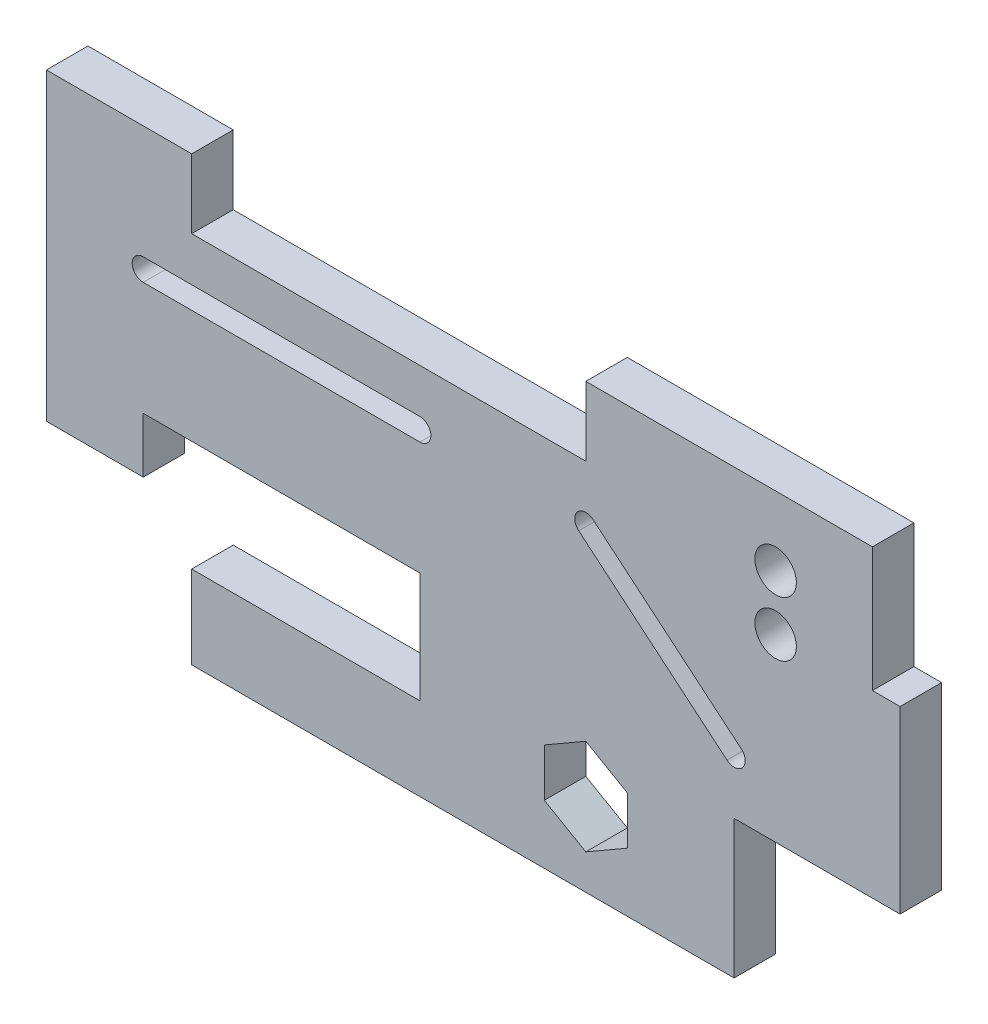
ISO-10303-21;
HEADER;
FILE_DESCRIPTION(('STEP AP214'),'2;1');
FILE_NAME('part.step','',(''),(''),'','','');
FILE_SCHEMA(('AUTOMOTIVE_DESIGN { 1 0 10303 214 1 1 1 1 }'));
ENDSEC;
DATA;
#1=APPLICATION_CONTEXT('core data for automotive mechanical design processes');
#2=APPLICATION_PROTOCOL_DEFINITION('international standard','automotive_design',2000,#1);
#3=PRODUCT_CONTEXT('',#1,'mechanical');
#4=PRODUCT('Part','Part','',(#3));
#5=PRODUCT_RELATED_PRODUCT_CATEGORY('part','',(#4));
#6=PRODUCT_DEFINITION_FORMATION('','',#4);
#7=PRODUCT_DEFINITION_CONTEXT('part definition',#1,'design');
#8=PRODUCT_DEFINITION('design','',#6,#7);
#9=PRODUCT_DEFINITION_SHAPE('','',#8);
#10=(LENGTH_UNIT() NAMED_UNIT(*) SI_UNIT(.MILLI.,.METRE.));
#11=(NAMED_UNIT(*) PLANE_ANGLE_UNIT() SI_UNIT($,.RADIAN.));
#12=(NAMED_UNIT(*) SI_UNIT($,.STERADIAN.) SOLID_ANGLE_UNIT());
#13=UNCERTAINTY_MEASURE_WITH_UNIT(LENGTH_MEASURE(1.E-05),#10,'distance_accuracy_value','');
#14=(GEOMETRIC_REPRESENTATION_CONTEXT(3) GLOBAL_UNCERTAINTY_ASSIGNED_CONTEXT((#13)) GLOBAL_UNIT_ASSIGNED_CONTEXT((#10,
#11,#12)) REPRESENTATION_CONTEXT('',''));
#15=CARTESIAN_POINT('',(0.,0.,0.));
#16=DIRECTION('',(0.,0.,1.));
#17=DIRECTION('',(1.,0.,0.));
#18=AXIS2_PLACEMENT_3D('',#15,#16,#17);
#19=CARTESIAN_POINT('',(0.,0.,9.525));
#20=DIRECTION('',(0.,0.,1.));
#21=DIRECTION('',(1.,0.,0.));
#22=AXIS2_PLACEMENT_3D('',#19,#20,#21);
#23=PLANE('',#22);
#24=CARTESIAN_POINT('',(81.6730818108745,53.975,9.525));
#25=DIRECTION('',(0.,0.,1.));
#26=DIRECTION('',(1.,0.,0.));
#27=AXIS2_PLACEMENT_3D('',#24,#25,#26);
#28=CIRCLE('',#27,4.7625);
#29=CARTESIAN_POINT('',(76.9105818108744,53.975,9.525));
#30=VERTEX_POINT('',#29);
#31=EDGE_CURVE('E364',#30,#30,#28,.T.);
#32=ORIENTED_EDGE('',*,*,#31,.F.);
#33=EDGE_LOOP('',(#32));
#34=FACE_BOUND('',#33,.T.);
#35=DIRECTION('',(-1.,0.,0.));
#36=VECTOR('',#35,1.);
#37=CARTESIAN_POINT('',(-52.3748,0.,9.525));
#38=LINE('',#37,#36);
#39=CARTESIAN_POINT('',(0.,0.,9.525));
#40=VERTEX_POINT('',#39);
#41=CARTESIAN_POINT('',(-52.3748,0.,9.525));
#42=VERTEX_POINT('',#41);
#43=EDGE_CURVE('E370',#40,#42,#38,.T.);
#44=ORIENTED_EDGE('',*,*,#43,.T.);
#45=DIRECTION('',(0.,-1.,0.));
#46=VECTOR('',#45,1.);
#47=CARTESIAN_POINT('',(-52.3748,-19.05,9.525));
#48=LINE('',#47,#46);
#49=CARTESIAN_POINT('',(-52.3748,-19.05,9.525));
#50=VERTEX_POINT('',#49);
#51=EDGE_CURVE('E373',#42,#50,#48,.T.);
#52=ORIENTED_EDGE('',*,*,#51,.T.);
#53=DIRECTION('',(1.,0.,0.));
#54=VECTOR('',#53,1.);
#55=CARTESIAN_POINT('',(72.1480818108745,-19.05,9.525));
#56=LINE('',#55,#54);
#57=CARTESIAN_POINT('',(72.1480818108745,-19.05,9.525));
#58=VERTEX_POINT('',#57);
#59=EDGE_CURVE('E376',#50,#58,#56,.T.);
#60=ORIENTED_EDGE('',*,*,#59,.T.);
#61=DIRECTION('',(0.,1.,0.));
#62=VECTOR('',#61,1.);
#63=CARTESIAN_POINT('',(72.1480818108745,12.7,9.525));
#64=LINE('',#63,#62);
#65=CARTESIAN_POINT('',(72.1480818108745,12.7,9.525));
#66=VERTEX_POINT('',#65);
#67=EDGE_CURVE('E378',#58,#66,#64,.T.);
#68=ORIENTED_EDGE('',*,*,#67,.T.);
#69=DIRECTION('',(1.,0.,0.));
#70=VECTOR('',#69,1.);
#71=CARTESIAN_POINT('',(110.248081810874,12.7,9.525));
#72=LINE('',#71,#70);
#73=CARTESIAN_POINT('',(110.248081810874,12.7,9.525));
#74=VERTEX_POINT('',#73);
#75=EDGE_CURVE('E380',#66,#74,#72,.T.);
#76=ORIENTED_EDGE('',*,*,#75,.T.);
#77=DIRECTION('',(0.,1.,0.));
#78=VECTOR('',#77,1.);
#79=CARTESIAN_POINT('',(110.248081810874,53.975,9.525));
#80=LINE('',#79,#78);
#81=CARTESIAN_POINT('',(110.248081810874,53.975,9.525));
#82=VERTEX_POINT('',#81);
#83=EDGE_CURVE('E382',#74,#82,#80,.T.);
#84=ORIENTED_EDGE('',*,*,#83,.T.);
#85=DIRECTION('',(-1.,0.,0.));
#86=VECTOR('',#85,1.);
#87=CARTESIAN_POINT('',(103.898081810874,53.975,9.525));
#88=LINE('',#87,#86);
#89=CARTESIAN_POINT('',(103.898081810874,53.975,9.525));
#90=VERTEX_POINT('',#89);
#91=EDGE_CURVE('E384',#82,#90,#88,.T.);
#92=ORIENTED_EDGE('',*,*,#91,.T.);
#93=DIRECTION('',(0.,1.,0.));
#94=VECTOR('',#93,1.);
#95=CARTESIAN_POINT('',(103.898081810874,82.55,9.525));
#96=LINE('',#95,#94);
#97=CARTESIAN_POINT('',(103.898081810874,82.55,9.525));
#98=VERTEX_POINT('',#97);
#99=EDGE_CURVE('E386',#90,#98,#96,.T.);
#100=ORIENTED_EDGE('',*,*,#99,.T.);
#101=DIRECTION('',(-1.,0.,0.));
#102=VECTOR('',#101,1.);
#103=CARTESIAN_POINT('',(38.1,82.55,9.525));
#104=LINE('',#103,#102);
#105=CARTESIAN_POINT('',(38.1,82.55,9.525));
#106=VERTEX_POINT('',#105);
#107=EDGE_CURVE('E388',#98,#106,#104,.T.);
#108=ORIENTED_EDGE('',*,*,#107,.T.);
#109=DIRECTION('',(0.,-1.,0.));
#110=VECTOR('',#109,1.);
#111=CARTESIAN_POINT('',(38.1,66.675,9.525));
#112=LINE('',#111,#110);
#113=CARTESIAN_POINT('',(38.1,66.675,9.525));
#114=VERTEX_POINT('',#113);
#115=EDGE_CURVE('E390',#106,#114,#112,.T.);
#116=ORIENTED_EDGE('',*,*,#115,.T.);
#117=DIRECTION('',(-1.,0.,0.));
#118=VECTOR('',#117,1.);
#119=CARTESIAN_POINT('',(-52.3748,66.675,9.525));
#120=LINE('',#119,#118);
#121=CARTESIAN_POINT('',(-52.3748,66.675,9.525));
#122=VERTEX_POINT('',#121);
#123=EDGE_CURVE('E392',#114,#122,#120,.T.);
#124=ORIENTED_EDGE('',*,*,#123,.T.);
#125=DIRECTION('',(0.,1.,0.));
#126=VECTOR('',#125,1.);
#127=CARTESIAN_POINT('',(-52.3748,82.55,9.525));
#128=LINE('',#127,#126);
#129=CARTESIAN_POINT('',(-52.3748,82.55,9.525));
#130=VERTEX_POINT('',#129);
#131=EDGE_CURVE('E394',#122,#130,#128,.T.);
#132=ORIENTED_EDGE('',*,*,#131,.T.);
#133=DIRECTION('',(-1.,0.,0.));
#134=VECTOR('',#133,1.);
#135=CARTESIAN_POINT('',(-85.725,82.55,9.525));
#136=LINE('',#135,#134);
#137=CARTESIAN_POINT('',(-85.725,82.55,9.525));
#138=VERTEX_POINT('',#137);
#139=EDGE_CURVE('E396',#130,#138,#136,.T.);
#140=ORIENTED_EDGE('',*,*,#139,.T.);
#141=DIRECTION('',(0.,-1.,0.));
#142=VECTOR('',#141,1.);
#143=CARTESIAN_POINT('',(-85.725,12.7,9.525));
#144=LINE('',#143,#142);
#145=CARTESIAN_POINT('',(-85.725,12.7,9.525));
#146=VERTEX_POINT('',#145);
#147=EDGE_CURVE('E398',#138,#146,#144,.T.);
#148=ORIENTED_EDGE('',*,*,#147,.T.);
#149=DIRECTION('',(1.,0.,0.));
#150=VECTOR('',#149,1.);
#151=CARTESIAN_POINT('',(-63.5,12.7,9.525));
#152=LINE('',#151,#150);
#153=CARTESIAN_POINT('',(-63.5,12.7,9.525));
#154=VERTEX_POINT('',#153);
#155=EDGE_CURVE('E400',#146,#154,#152,.T.);
#156=ORIENTED_EDGE('',*,*,#155,.T.);
#157=DIRECTION('',(0.,1.,0.));
#158=VECTOR('',#157,1.);
#159=CARTESIAN_POINT('',(-63.5,25.4,9.525));
#160=LINE('',#159,#158);
#161=CARTESIAN_POINT('',(-63.5,25.4,9.525));
#162=VERTEX_POINT('',#161);
#163=EDGE_CURVE('E402',#154,#162,#160,.T.);
#164=ORIENTED_EDGE('',*,*,#163,.T.);
#165=DIRECTION('',(1.,0.,0.));
#166=VECTOR('',#165,1.);
#167=CARTESIAN_POINT('',(0.,25.4,9.525));
#168=LINE('',#167,#166);
#169=CARTESIAN_POINT('',(0.,25.4,9.525));
#170=VERTEX_POINT('',#169);
#171=EDGE_CURVE('E404',#162,#170,#168,.T.);
#172=ORIENTED_EDGE('',*,*,#171,.T.);
#173=DIRECTION('',(0.,-1.,0.));
#174=VECTOR('',#173,1.);
#175=CARTESIAN_POINT('',(0.,0.,9.525));
#176=LINE('',#175,#174);
#177=EDGE_CURVE('E406',#170,#40,#176,.T.);
#178=ORIENTED_EDGE('',*,*,#177,.T.);
#179=EDGE_LOOP('',(#44,#52,#60,#68,#76,#84,#92,#100,#108,#116,#124,#132,#140,#148,#156,#164,
#172,#178));
#180=FACE_BOUND('',#179,.T.);
#181=CARTESIAN_POINT('',(81.6730818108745,66.675,9.525));
#182=DIRECTION('',(0.,0.,1.));
#183=DIRECTION('',(1.,0.,0.));
#184=AXIS2_PLACEMENT_3D('',#181,#182,#183);
#185=CIRCLE('',#184,4.7625);
#186=CARTESIAN_POINT('',(76.9105818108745,66.675,9.525));
#187=VERTEX_POINT('',#186);
#188=EDGE_CURVE('E358',#187,#187,#185,.T.);
#189=ORIENTED_EDGE('',*,*,#188,.F.);
#190=EDGE_LOOP('',(#189));
#191=FACE_BOUND('',#190,.T.);
#192=DIRECTION('',(1.,0.,0.));
#193=VECTOR('',#192,1.);
#194=CARTESIAN_POINT('',(-63.5,51.435,9.525));
#195=LINE('',#194,#193);
#196=CARTESIAN_POINT('',(-63.5,51.435,9.525));
#197=VERTEX_POINT('',#196);
#198=CARTESIAN_POINT('',(0.,51.435,9.525));
#199=VERTEX_POINT('',#198);
#200=EDGE_CURVE('E329',#197,#199,#195,.T.);
#201=ORIENTED_EDGE('',*,*,#200,.F.);
#202=CARTESIAN_POINT('',(-63.5,53.975,9.525));
#203=DIRECTION('',(0.,0.,1.));
#204=DIRECTION('',(1.,0.,0.));
#205=AXIS2_PLACEMENT_3D('',#202,#203,#204);
#206=CIRCLE('',#205,2.54);
#207=CARTESIAN_POINT('',(-63.5,56.515,9.525));
#208=VERTEX_POINT('',#207);
#209=EDGE_CURVE('E327',#208,#197,#206,.T.);
#210=ORIENTED_EDGE('',*,*,#209,.F.);
#211=DIRECTION('',(-1.,0.,0.));
#212=VECTOR('',#211,1.);
#213=CARTESIAN_POINT('',(-63.5,56.515,9.525));
#214=LINE('',#213,#212);
#215=CARTESIAN_POINT('',(0.,56.515,9.525));
#216=VERTEX_POINT('',#215);
#217=EDGE_CURVE('E335',#216,#208,#214,.T.);
#218=ORIENTED_EDGE('',*,*,#217,.F.);
#219=CARTESIAN_POINT('',(0.,53.975,9.525));
#220=DIRECTION('',(0.,0.,1.));
#221=DIRECTION('',(1.,0.,0.));
#222=AXIS2_PLACEMENT_3D('',#219,#220,#221);
#223=CIRCLE('',#222,2.54);
#224=EDGE_CURVE('E332',#199,#216,#223,.T.);
#225=ORIENTED_EDGE('',*,*,#224,.F.);
#226=EDGE_LOOP('',(#201,#210,#218,#225));
#227=FACE_BOUND('',#226,.T.);
#228=DIRECTION('',(-0.866025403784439,-0.5,0.));
#229=VECTOR('',#228,1.);
#230=CARTESIAN_POINT('',(38.1,10.9985226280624,9.525));
#231=LINE('',#230,#229);
#232=CARTESIAN_POINT('',(38.1,10.9985226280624,9.525));
#233=VERTEX_POINT('',#232);
#234=CARTESIAN_POINT('',(28.575,5.49926131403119,9.525));
#235=VERTEX_POINT('',#234);
#236=EDGE_CURVE('E284',#233,#235,#231,.T.);
#237=ORIENTED_EDGE('',*,*,#236,.F.);
#238=DIRECTION('',(-0.866025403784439,0.5,0.));
#239=VECTOR('',#238,1.);
#240=CARTESIAN_POINT('',(47.625,5.49926131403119,9.525));
#241=LINE('',#240,#239);
#242=CARTESIAN_POINT('',(47.625,5.49926131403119,9.525));
#243=VERTEX_POINT('',#242);
#244=EDGE_CURVE('E282',#243,#233,#241,.T.);
#245=ORIENTED_EDGE('',*,*,#244,.F.);
#246=DIRECTION('',(0.,1.,0.));
#247=VECTOR('',#246,1.);
#248=CARTESIAN_POINT('',(47.625,-5.49926131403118,9.525));
#249=LINE('',#248,#247);
#250=CARTESIAN_POINT('',(47.625,-5.49926131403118,9.525));
#251=VERTEX_POINT('',#250);
#252=EDGE_CURVE('E294',#251,#243,#249,.T.);
#253=ORIENTED_EDGE('',*,*,#252,.F.);
#254=DIRECTION('',(0.866025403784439,0.5,0.));
#255=VECTOR('',#254,1.);
#256=CARTESIAN_POINT('',(38.1,-10.9985226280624,9.525));
#257=LINE('',#256,#255);
#258=CARTESIAN_POINT('',(38.1,-10.9985226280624,9.525));
#259=VERTEX_POINT('',#258);
#260=EDGE_CURVE('E291',#259,#251,#257,.T.);
#261=ORIENTED_EDGE('',*,*,#260,.F.);
#262=DIRECTION('',(0.866025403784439,-0.5,0.));
#263=VECTOR('',#262,1.);
#264=CARTESIAN_POINT('',(28.575,-5.49926131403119,9.525));
#265=LINE('',#264,#263);
#266=CARTESIAN_POINT('',(28.575,-5.49926131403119,9.525));
#267=VERTEX_POINT('',#266);
#268=EDGE_CURVE('E289',#267,#259,#265,.T.);
#269=ORIENTED_EDGE('',*,*,#268,.F.);
#270=DIRECTION('',(0.,-1.,0.));
#271=VECTOR('',#270,1.);
#272=CARTESIAN_POINT('',(28.575,5.49926131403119,9.525));
#273=LINE('',#272,#271);
#274=EDGE_CURVE('E287',#235,#267,#273,.T.);
#275=ORIENTED_EDGE('',*,*,#274,.F.);
#276=EDGE_LOOP('',(#237,#245,#253,#261,#269,#275));
#277=FACE_BOUND('',#276,.T.);
#278=DIRECTION('',(0.765986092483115,-0.642857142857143,0.));
#279=VECTOR('',#278,1.);
#280=CARTESIAN_POINT('',(36.4671428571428,52.0293953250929,9.525));
#281=LINE('',#280,#279);
#282=CARTESIAN_POINT('',(36.4671428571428,52.0293953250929,9.525));
#283=VERTEX_POINT('',#282);
#284=CARTESIAN_POINT('',(70.5152246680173,23.4543953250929,9.525));
#285=VERTEX_POINT('',#284);
#286=EDGE_CURVE('E254',#283,#285,#281,.T.);
#287=ORIENTED_EDGE('',*,*,#286,.F.);
#288=CARTESIAN_POINT('',(38.1,53.975,9.525));
#289=DIRECTION('',(0.,0.,1.));
#290=DIRECTION('',(1.,0.,0.));
#291=AXIS2_PLACEMENT_3D('',#288,#289,#290);
#292=CIRCLE('',#291,2.54000000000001);
#293=CARTESIAN_POINT('',(39.7328571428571,55.9206046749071,9.525));
#294=VERTEX_POINT('',#293);
#295=EDGE_CURVE('E246',#294,#283,#292,.T.);
#296=ORIENTED_EDGE('',*,*,#295,.F.);
#297=DIRECTION('',(-0.765986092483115,0.642857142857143,0.));
#298=VECTOR('',#297,1.);
#299=CARTESIAN_POINT('',(39.7328571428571,55.9206046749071,9.525));
#300=LINE('',#299,#298);
#301=CARTESIAN_POINT('',(73.7809389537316,27.3456046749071,9.525));
#302=VERTEX_POINT('',#301);
#303=EDGE_CURVE('E268',#302,#294,#300,.T.);
#304=ORIENTED_EDGE('',*,*,#303,.F.);
#305=CARTESIAN_POINT('',(72.1480818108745,25.4,9.525));
#306=DIRECTION('',(0.,0.,1.));
#307=DIRECTION('',(1.,0.,0.));
#308=AXIS2_PLACEMENT_3D('',#305,#306,#307);
#309=CIRCLE('',#308,2.54000000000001);
#310=EDGE_CURVE('E266',#285,#302,#309,.T.);
#311=ORIENTED_EDGE('',*,*,#310,.F.);
#312=EDGE_LOOP('',(#287,#296,#304,#311));
#313=FACE_BOUND('',#312,.T.);
#314=ADVANCED_FACE('F37',(#34,#180,#191,#227,#277,#313),#23,.T.);
#315=CARTESIAN_POINT('',(0.,0.,0.));
#316=DIRECTION('',(0.,0.,1.));
#317=DIRECTION('',(1.,0.,0.));
#318=AXIS2_PLACEMENT_3D('',#315,#316,#317);
#319=PLANE('',#318);
#320=DIRECTION('',(-0.866025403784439,0.5,0.));
#321=VECTOR('',#320,1.);
#322=CARTESIAN_POINT('',(47.625,5.49926131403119,0.));
#323=LINE('',#322,#321);
#324=CARTESIAN_POINT('',(47.625,5.49926131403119,0.));
#325=VERTEX_POINT('',#324);
#326=CARTESIAN_POINT('',(38.1,10.9985226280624,0.));
#327=VERTEX_POINT('',#326);
#328=EDGE_CURVE('E262',#325,#327,#323,.T.);
#329=ORIENTED_EDGE('',*,*,#328,.T.);
#330=DIRECTION('',(-0.866025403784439,-0.5,0.));
#331=VECTOR('',#330,1.);
#332=CARTESIAN_POINT('',(38.1,10.9985226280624,0.));
#333=LINE('',#332,#331);
#334=CARTESIAN_POINT('',(28.575,5.49926131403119,0.));
#335=VERTEX_POINT('',#334);
#336=EDGE_CURVE('E299',#327,#335,#333,.T.);
#337=ORIENTED_EDGE('',*,*,#336,.T.);
#338=DIRECTION('',(0.,-1.,0.));
#339=VECTOR('',#338,1.);
#340=CARTESIAN_POINT('',(28.575,5.49926131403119,0.));
#341=LINE('',#340,#339);
#342=CARTESIAN_POINT('',(28.575,-5.49926131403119,0.));
#343=VERTEX_POINT('',#342);
#344=EDGE_CURVE('E302',#335,#343,#341,.T.);
#345=ORIENTED_EDGE('',*,*,#344,.T.);
#346=DIRECTION('',(0.866025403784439,-0.5,0.));
#347=VECTOR('',#346,1.);
#348=CARTESIAN_POINT('',(28.575,-5.49926131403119,0.));
#349=LINE('',#348,#347);
#350=CARTESIAN_POINT('',(38.1,-10.9985226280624,0.));
#351=VERTEX_POINT('',#350);
#352=EDGE_CURVE('E305',#343,#351,#349,.T.);
#353=ORIENTED_EDGE('',*,*,#352,.T.);
#354=DIRECTION('',(0.866025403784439,0.5,0.));
#355=VECTOR('',#354,1.);
#356=CARTESIAN_POINT('',(38.1,-10.9985226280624,0.));
#357=LINE('',#356,#355);
#358=CARTESIAN_POINT('',(47.625,-5.49926131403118,0.));
#359=VERTEX_POINT('',#358);
#360=EDGE_CURVE('E308',#351,#359,#357,.T.);
#361=ORIENTED_EDGE('',*,*,#360,.T.);
#362=DIRECTION('',(0.,1.,0.));
#363=VECTOR('',#362,1.);
#364=CARTESIAN_POINT('',(47.625,-5.49926131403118,0.));
#365=LINE('',#364,#363);
#366=EDGE_CURVE('E285',#359,#325,#365,.T.);
#367=ORIENTED_EDGE('',*,*,#366,.T.);
#368=EDGE_LOOP('',(#329,#337,#345,#353,#361,#367));
#369=FACE_BOUND('',#368,.T.);
#370=CARTESIAN_POINT('',(81.6730818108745,66.675,0.));
#371=DIRECTION('',(0.,0.,1.));
#372=DIRECTION('',(1.,0.,0.));
#373=AXIS2_PLACEMENT_3D('',#370,#371,#372);
#374=CIRCLE('',#373,4.7625);
#375=CARTESIAN_POINT('',(76.9105818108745,66.675,0.));
#376=VERTEX_POINT('',#375);
#377=EDGE_CURVE('E357',#376,#376,#374,.T.);
#378=ORIENTED_EDGE('',*,*,#377,.T.);
#379=EDGE_LOOP('',(#378));
#380=FACE_BOUND('',#379,.T.);
#381=CARTESIAN_POINT('',(81.6730818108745,53.975,0.));
#382=DIRECTION('',(0.,0.,1.));
#383=DIRECTION('',(1.,0.,0.));
#384=AXIS2_PLACEMENT_3D('',#381,#382,#383);
#385=CIRCLE('',#384,4.7625);
#386=CARTESIAN_POINT('',(76.9105818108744,53.975,0.));
#387=VERTEX_POINT('',#386);
#388=EDGE_CURVE('E361',#387,#387,#385,.T.);
#389=ORIENTED_EDGE('',*,*,#388,.T.);
#390=EDGE_LOOP('',(#389));
#391=FACE_BOUND('',#390,.T.);
#392=DIRECTION('',(-1.,0.,0.));
#393=VECTOR('',#392,1.);
#394=CARTESIAN_POINT('',(-52.3748,0.,0.));
#395=LINE('',#394,#393);
#396=CARTESIAN_POINT('',(0.,0.,0.));
#397=VERTEX_POINT('',#396);
#398=CARTESIAN_POINT('',(-52.3748,0.,0.));
#399=VERTEX_POINT('',#398);
#400=EDGE_CURVE('E367',#397,#399,#395,.T.);
#401=ORIENTED_EDGE('',*,*,#400,.F.);
#402=DIRECTION('',(0.,-1.,0.));
#403=VECTOR('',#402,1.);
#404=CARTESIAN_POINT('',(0.,0.,0.));
#405=LINE('',#404,#403);
#406=CARTESIAN_POINT('',(0.,25.4,0.));
#407=VERTEX_POINT('',#406);
#408=EDGE_CURVE('E374',#407,#397,#405,.T.);
#409=ORIENTED_EDGE('',*,*,#408,.F.);
#410=DIRECTION('',(1.,0.,0.));
#411=VECTOR('',#410,1.);
#412=CARTESIAN_POINT('',(0.,25.4,0.));
#413=LINE('',#412,#411);
#414=CARTESIAN_POINT('',(-63.5,25.4,0.));
#415=VERTEX_POINT('',#414);
#416=EDGE_CURVE('E441',#415,#407,#413,.T.);
#417=ORIENTED_EDGE('',*,*,#416,.F.);
#418=DIRECTION('',(0.,1.,0.));
#419=VECTOR('',#418,1.);
#420=CARTESIAN_POINT('',(-63.5,25.4,0.));
#421=LINE('',#420,#419);
#422=CARTESIAN_POINT('',(-63.5,12.7,0.));
#423=VERTEX_POINT('',#422);
#424=EDGE_CURVE('E439',#423,#415,#421,.T.);
#425=ORIENTED_EDGE('',*,*,#424,.F.);
#426=DIRECTION('',(1.,0.,0.));
#427=VECTOR('',#426,1.);
#428=CARTESIAN_POINT('',(-63.5,12.7,0.));
#429=LINE('',#428,#427);
#430=CARTESIAN_POINT('',(-85.725,12.7,0.));
#431=VERTEX_POINT('',#430);
#432=EDGE_CURVE('E437',#431,#423,#429,.T.);
#433=ORIENTED_EDGE('',*,*,#432,.F.);
#434=DIRECTION('',(0.,-1.,0.));
#435=VECTOR('',#434,1.);
#436=CARTESIAN_POINT('',(-85.725,12.7,0.));
#437=LINE('',#436,#435);
#438=CARTESIAN_POINT('',(-85.725,82.55,0.));
#439=VERTEX_POINT('',#438);
#440=EDGE_CURVE('E435',#439,#431,#437,.T.);
#441=ORIENTED_EDGE('',*,*,#440,.F.);
#442=DIRECTION('',(-1.,0.,0.));
#443=VECTOR('',#442,1.);
#444=CARTESIAN_POINT('',(-85.725,82.55,0.));
#445=LINE('',#444,#443);
#446=CARTESIAN_POINT('',(-52.3748,82.55,0.));
#447=VERTEX_POINT('',#446);
#448=EDGE_CURVE('E433',#447,#439,#445,.T.);
#449=ORIENTED_EDGE('',*,*,#448,.F.);
#450=DIRECTION('',(0.,1.,0.));
#451=VECTOR('',#450,1.);
#452=CARTESIAN_POINT('',(-52.3748,82.55,0.));
#453=LINE('',#452,#451);
#454=CARTESIAN_POINT('',(-52.3748,66.675,0.));
#455=VERTEX_POINT('',#454);
#456=EDGE_CURVE('E431',#455,#447,#453,.T.);
#457=ORIENTED_EDGE('',*,*,#456,.F.);
#458=DIRECTION('',(-1.,0.,0.));
#459=VECTOR('',#458,1.);
#460=CARTESIAN_POINT('',(-52.3748,66.675,0.));
#461=LINE('',#460,#459);
#462=CARTESIAN_POINT('',(38.1,66.675,0.));
#463=VERTEX_POINT('',#462);
#464=EDGE_CURVE('E429',#463,#455,#461,.T.);
#465=ORIENTED_EDGE('',*,*,#464,.F.);
#466=DIRECTION('',(0.,-1.,0.));
#467=VECTOR('',#466,1.);
#468=CARTESIAN_POINT('',(38.1,66.675,0.));
#469=LINE('',#468,#467);
#470=CARTESIAN_POINT('',(38.1,82.55,0.));
#471=VERTEX_POINT('',#470);
#472=EDGE_CURVE('E427',#471,#463,#469,.T.);
#473=ORIENTED_EDGE('',*,*,#472,.F.);
#474=DIRECTION('',(-1.,0.,0.));
#475=VECTOR('',#474,1.);
#476=CARTESIAN_POINT('',(38.1,82.55,0.));
#477=LINE('',#476,#475);
#478=CARTESIAN_POINT('',(103.898081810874,82.55,0.));
#479=VERTEX_POINT('',#478);
#480=EDGE_CURVE('E425',#479,#471,#477,.T.);
#481=ORIENTED_EDGE('',*,*,#480,.F.);
#482=DIRECTION('',(0.,1.,0.));
#483=VECTOR('',#482,1.);
#484=CARTESIAN_POINT('',(103.898081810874,82.55,0.));
#485=LINE('',#484,#483);
#486=CARTESIAN_POINT('',(103.898081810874,53.975,0.));
#487=VERTEX_POINT('',#486);
#488=EDGE_CURVE('E423',#487,#479,#485,.T.);
#489=ORIENTED_EDGE('',*,*,#488,.F.);
#490=DIRECTION('',(-1.,0.,0.));
#491=VECTOR('',#490,1.);
#492=CARTESIAN_POINT('',(103.898081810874,53.975,0.));
#493=LINE('',#492,#491);
#494=CARTESIAN_POINT('',(110.248081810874,53.975,0.));
#495=VERTEX_POINT('',#494);
#496=EDGE_CURVE('E421',#495,#487,#493,.T.);
#497=ORIENTED_EDGE('',*,*,#496,.F.);
#498=DIRECTION('',(0.,1.,0.));
#499=VECTOR('',#498,1.);
#500=CARTESIAN_POINT('',(110.248081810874,53.975,0.));
#501=LINE('',#500,#499);
#502=CARTESIAN_POINT('',(110.248081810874,12.7,0.));
#503=VERTEX_POINT('',#502);
#504=EDGE_CURVE('E419',#503,#495,#501,.T.);
#505=ORIENTED_EDGE('',*,*,#504,.F.);
#506=DIRECTION('',(1.,0.,0.));
#507=VECTOR('',#506,1.);
#508=CARTESIAN_POINT('',(110.248081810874,12.7,0.));
#509=LINE('',#508,#507);
#510=CARTESIAN_POINT('',(72.1480818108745,12.7,0.));
#511=VERTEX_POINT('',#510);
#512=EDGE_CURVE('E417',#511,#503,#509,.T.);
#513=ORIENTED_EDGE('',*,*,#512,.F.);
#514=DIRECTION('',(0.,1.,0.));
#515=VECTOR('',#514,1.);
#516=CARTESIAN_POINT('',(72.1480818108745,12.7,0.));
#517=LINE('',#516,#515);
#518=CARTESIAN_POINT('',(72.1480818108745,-19.05,0.));
#519=VERTEX_POINT('',#518);
#520=EDGE_CURVE('E415',#519,#511,#517,.T.);
#521=ORIENTED_EDGE('',*,*,#520,.F.);
#522=DIRECTION('',(1.,0.,0.));
#523=VECTOR('',#522,1.);
#524=CARTESIAN_POINT('',(72.1480818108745,-19.05,0.));
#525=LINE('',#524,#523);
#526=CARTESIAN_POINT('',(-52.3748,-19.05,0.));
#527=VERTEX_POINT('',#526);
#528=EDGE_CURVE('E413',#527,#519,#525,.T.);
#529=ORIENTED_EDGE('',*,*,#528,.F.);
#530=DIRECTION('',(0.,-1.,0.));
#531=VECTOR('',#530,1.);
#532=CARTESIAN_POINT('',(-52.3748,-19.05,0.));
#533=LINE('',#532,#531);
#534=EDGE_CURVE('E411',#399,#527,#533,.T.);
#535=ORIENTED_EDGE('',*,*,#534,.F.);
#536=EDGE_LOOP('',(#401,#409,#417,#425,#433,#441,#449,#457,#465,#473,#481,#489,#497,#505,#513,
#521,#529,#535));
#537=FACE_BOUND('',#536,.T.);
#538=CARTESIAN_POINT('',(-63.5,53.975,0.));
#539=DIRECTION('',(0.,0.,1.));
#540=DIRECTION('',(1.,0.,0.));
#541=AXIS2_PLACEMENT_3D('',#538,#539,#540);
#542=CIRCLE('',#541,2.54);
#543=CARTESIAN_POINT('',(-63.5,56.515,0.));
#544=VERTEX_POINT('',#543);
#545=CARTESIAN_POINT('',(-63.5,51.435,0.));
#546=VERTEX_POINT('',#545);
#547=EDGE_CURVE('E326',#544,#546,#542,.T.);
#548=ORIENTED_EDGE('',*,*,#547,.T.);
#549=DIRECTION('',(1.,0.,0.));
#550=VECTOR('',#549,1.);
#551=CARTESIAN_POINT('',(-63.5,51.435,0.));
#552=LINE('',#551,#550);
#553=CARTESIAN_POINT('',(0.,51.435,0.));
#554=VERTEX_POINT('',#553);
#555=EDGE_CURVE('E340',#546,#554,#552,.T.);
#556=ORIENTED_EDGE('',*,*,#555,.T.);
#557=CARTESIAN_POINT('',(0.,53.975,0.));
#558=DIRECTION('',(0.,0.,1.));
#559=DIRECTION('',(1.,0.,0.));
#560=AXIS2_PLACEMENT_3D('',#557,#558,#559);
#561=CIRCLE('',#560,2.54);
#562=CARTESIAN_POINT('',(0.,56.515,0.));
#563=VERTEX_POINT('',#562);
#564=EDGE_CURVE('E343',#554,#563,#561,.T.);
#565=ORIENTED_EDGE('',*,*,#564,.T.);
#566=DIRECTION('',(-1.,0.,0.));
#567=VECTOR('',#566,1.);
#568=CARTESIAN_POINT('',(-63.5,56.515,0.));
#569=LINE('',#568,#567);
#570=EDGE_CURVE('E330',#563,#544,#569,.T.);
#571=ORIENTED_EDGE('',*,*,#570,.T.);
#572=EDGE_LOOP('',(#548,#556,#565,#571));
#573=FACE_BOUND('',#572,.T.);
#574=CARTESIAN_POINT('',(38.1,53.975,0.));
#575=DIRECTION('',(0.,0.,1.));
#576=DIRECTION('',(1.,0.,0.));
#577=AXIS2_PLACEMENT_3D('',#574,#575,#576);
#578=CIRCLE('',#577,2.54000000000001);
#579=CARTESIAN_POINT('',(39.7328571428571,55.9206046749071,0.));
#580=VERTEX_POINT('',#579);
#581=CARTESIAN_POINT('',(36.4671428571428,52.0293953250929,0.));
#582=VERTEX_POINT('',#581);
#583=EDGE_CURVE('E60',#580,#582,#578,.T.);
#584=ORIENTED_EDGE('',*,*,#583,.T.);
#585=DIRECTION('',(0.765986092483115,-0.642857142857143,0.));
#586=VECTOR('',#585,1.);
#587=CARTESIAN_POINT('',(36.4671428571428,52.0293953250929,0.));
#588=LINE('',#587,#586);
#589=CARTESIAN_POINT('',(70.5152246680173,23.4543953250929,0.));
#590=VERTEX_POINT('',#589);
#591=EDGE_CURVE('E261',#582,#590,#588,.T.);
#592=ORIENTED_EDGE('',*,*,#591,.T.);
#593=CARTESIAN_POINT('',(72.1480818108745,25.4,0.));
#594=DIRECTION('',(0.,0.,1.));
#595=DIRECTION('',(1.,0.,0.));
#596=AXIS2_PLACEMENT_3D('',#593,#594,#595);
#597=CIRCLE('',#596,2.54000000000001);
#598=CARTESIAN_POINT('',(73.7809389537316,27.3456046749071,0.));
#599=VERTEX_POINT('',#598);
#600=EDGE_CURVE('E274',#590,#599,#597,.T.);
#601=ORIENTED_EDGE('',*,*,#600,.T.);
#602=DIRECTION('',(-0.765986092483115,0.642857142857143,0.));
#603=VECTOR('',#602,1.);
#604=CARTESIAN_POINT('',(39.7328571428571,55.9206046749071,0.));
#605=LINE('',#604,#603);
#606=EDGE_CURVE('E255',#599,#580,#605,.T.);
#607=ORIENTED_EDGE('',*,*,#606,.T.);
#608=EDGE_LOOP('',(#584,#592,#601,#607));
#609=FACE_BOUND('',#608,.T.);
#610=ADVANCED_FACE('F501',(#369,#380,#391,#537,#573,#609),#319,.F.);
#611=CARTESIAN_POINT('',(-52.3748,0.,9.525));
#612=DIRECTION('',(0.,-1.,0.));
#613=DIRECTION('',(0.,0.,-1.));
#614=AXIS2_PLACEMENT_3D('',#611,#612,#613);
#615=PLANE('',#614);
#616=ORIENTED_EDGE('',*,*,#400,.T.);
#617=DIRECTION('',(0.,0.,-1.));
#618=VECTOR('',#617,1.);
#619=CARTESIAN_POINT('',(-52.3748,0.,9.525));
#620=LINE('',#619,#618);
#621=EDGE_CURVE('E11',#42,#399,#620,.T.);
#622=ORIENTED_EDGE('',*,*,#621,.F.);
#623=ORIENTED_EDGE('',*,*,#43,.F.);
#624=DIRECTION('',(0.,0.,-1.));
#625=VECTOR('',#624,1.);
#626=CARTESIAN_POINT('',(0.,0.,9.525));
#627=LINE('',#626,#625);
#628=EDGE_CURVE('E408',#40,#397,#627,.T.);
#629=ORIENTED_EDGE('',*,*,#628,.T.);
#630=EDGE_LOOP('',(#616,#622,#623,#629));
#631=FACE_BOUND('',#630,.T.);
#632=ADVANCED_FACE('F39',(#631),#615,.F.);
#633=CARTESIAN_POINT('',(-52.3748,-19.05,9.525));
#634=DIRECTION('',(1.,0.,0.));
#635=DIRECTION('',(0.,0.,-1.));
#636=AXIS2_PLACEMENT_3D('',#633,#634,#635);
#637=PLANE('',#636);
#638=ORIENTED_EDGE('',*,*,#534,.T.);
#639=DIRECTION('',(0.,0.,-1.));
#640=VECTOR('',#639,1.);
#641=CARTESIAN_POINT('',(-52.3748,-19.05,9.525));
#642=LINE('',#641,#640);
#643=EDGE_CURVE('E45',#50,#527,#642,.T.);
#644=ORIENTED_EDGE('',*,*,#643,.F.);
#645=ORIENTED_EDGE('',*,*,#51,.F.);
#646=ORIENTED_EDGE('',*,*,#621,.T.);
#647=EDGE_LOOP('',(#638,#644,#645,#646));
#648=FACE_BOUND('',#647,.T.);
#649=ADVANCED_FACE('F519',(#648),#637,.F.);
#650=CARTESIAN_POINT('',(72.1480818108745,-19.05,9.525));
#651=DIRECTION('',(0.,1.,0.));
#652=DIRECTION('',(-1.,0.,0.));
#653=AXIS2_PLACEMENT_3D('',#650,#651,#652);
#654=PLANE('',#653);
#655=ORIENTED_EDGE('',*,*,#528,.T.);
#656=DIRECTION('',(0.,0.,-1.));
#657=VECTOR('',#656,1.);
#658=CARTESIAN_POINT('',(72.1480818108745,-19.05,9.525));
#659=LINE('',#658,#657);
#660=EDGE_CURVE('E488',#58,#519,#659,.T.);
#661=ORIENTED_EDGE('',*,*,#660,.F.);
#662=ORIENTED_EDGE('',*,*,#59,.F.);
#663=ORIENTED_EDGE('',*,*,#643,.T.);
#664=EDGE_LOOP('',(#655,#661,#662,#663));
#665=FACE_BOUND('',#664,.T.);
#666=ADVANCED_FACE('F495',(#665),#654,.F.);
#667=CARTESIAN_POINT('',(72.1480818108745,12.7,9.525));
#668=DIRECTION('',(-1.,0.,0.));
#669=DIRECTION('',(0.,-1.,0.));
#670=AXIS2_PLACEMENT_3D('',#667,#668,#669);
#671=PLANE('',#670);
#672=ORIENTED_EDGE('',*,*,#520,.T.);
#673=DIRECTION('',(0.,0.,-1.));
#674=VECTOR('',#673,1.);
#675=CARTESIAN_POINT('',(72.1480818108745,12.7,9.525));
#676=LINE('',#675,#674);
#677=EDGE_CURVE('E485',#66,#511,#676,.T.);
#678=ORIENTED_EDGE('',*,*,#677,.F.);
#679=ORIENTED_EDGE('',*,*,#67,.F.);
#680=ORIENTED_EDGE('',*,*,#660,.T.);
#681=EDGE_LOOP('',(#672,#678,#679,#680));
#682=FACE_BOUND('',#681,.T.);
#683=ADVANCED_FACE('F507',(#682),#671,.F.);
#684=CARTESIAN_POINT('',(110.248081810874,12.7,9.525));
#685=DIRECTION('',(0.,1.,0.));
#686=DIRECTION('',(-1.,0.,0.));
#687=AXIS2_PLACEMENT_3D('',#684,#685,#686);
#688=PLANE('',#687);
#689=ORIENTED_EDGE('',*,*,#512,.T.);
#690=DIRECTION('',(0.,0.,-1.));
#691=VECTOR('',#690,1.);
#692=CARTESIAN_POINT('',(110.248081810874,12.7,9.525));
#693=LINE('',#692,#691);
#694=EDGE_CURVE('E482',#74,#503,#693,.T.);
#695=ORIENTED_EDGE('',*,*,#694,.F.);
#696=ORIENTED_EDGE('',*,*,#75,.F.);
#697=ORIENTED_EDGE('',*,*,#677,.T.);
#698=EDGE_LOOP('',(#689,#695,#696,#697));
#699=FACE_BOUND('',#698,.T.);
#700=ADVANCED_FACE('F511',(#699),#688,.F.);
#701=CARTESIAN_POINT('',(110.248081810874,53.975,9.525));
#702=DIRECTION('',(-1.,0.,0.));
#703=DIRECTION('',(0.,-1.,0.));
#704=AXIS2_PLACEMENT_3D('',#701,#702,#703);
#705=PLANE('',#704);
#706=ORIENTED_EDGE('',*,*,#504,.T.);
#707=DIRECTION('',(0.,0.,-1.));
#708=VECTOR('',#707,1.);
#709=CARTESIAN_POINT('',(110.248081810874,53.975,9.525));
#710=LINE('',#709,#708);
#711=EDGE_CURVE('E479',#82,#495,#710,.T.);
#712=ORIENTED_EDGE('',*,*,#711,.F.);
#713=ORIENTED_EDGE('',*,*,#83,.F.);
#714=ORIENTED_EDGE('',*,*,#694,.T.);
#715=EDGE_LOOP('',(#706,#712,#713,#714));
#716=FACE_BOUND('',#715,.T.);
#717=ADVANCED_FACE('F582',(#716),#705,.F.);
#718=CARTESIAN_POINT('',(103.898081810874,53.975,9.525));
#719=DIRECTION('',(0.,-1.,0.));
#720=DIRECTION('',(1.,0.,0.));
#721=AXIS2_PLACEMENT_3D('',#718,#719,#720);
#722=PLANE('',#721);
#723=ORIENTED_EDGE('',*,*,#496,.T.);
#724=DIRECTION('',(0.,0.,-1.));
#725=VECTOR('',#724,1.);
#726=CARTESIAN_POINT('',(103.898081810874,53.975,9.525));
#727=LINE('',#726,#725);
#728=EDGE_CURVE('E476',#90,#487,#727,.T.);
#729=ORIENTED_EDGE('',*,*,#728,.F.);
#730=ORIENTED_EDGE('',*,*,#91,.F.);
#731=ORIENTED_EDGE('',*,*,#711,.T.);
#732=EDGE_LOOP('',(#723,#729,#730,#731));
#733=FACE_BOUND('',#732,.T.);
#734=ADVANCED_FACE('F580',(#733),#722,.F.);
#735=CARTESIAN_POINT('',(103.898081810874,82.55,9.525));
#736=DIRECTION('',(-1.,0.,0.));
#737=DIRECTION('',(0.,0.,1.));
#738=AXIS2_PLACEMENT_3D('',#735,#736,#737);
#739=PLANE('',#738);
#740=ORIENTED_EDGE('',*,*,#488,.T.);
#741=DIRECTION('',(0.,0.,-1.));
#742=VECTOR('',#741,1.);
#743=CARTESIAN_POINT('',(103.898081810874,82.55,9.525));
#744=LINE('',#743,#742);
#745=EDGE_CURVE('E473',#98,#479,#744,.T.);
#746=ORIENTED_EDGE('',*,*,#745,.F.);
#747=ORIENTED_EDGE('',*,*,#99,.F.);
#748=ORIENTED_EDGE('',*,*,#728,.T.);
#749=EDGE_LOOP('',(#740,#746,#747,#748));
#750=FACE_BOUND('',#749,.T.);
#751=ADVANCED_FACE('F576',(#750),#739,.F.);
#752=CARTESIAN_POINT('',(38.1,82.55,9.525));
#753=DIRECTION('',(0.,-1.,0.));
#754=DIRECTION('',(0.,0.,-1.));
#755=AXIS2_PLACEMENT_3D('',#752,#753,#754);
#756=PLANE('',#755);
#757=ORIENTED_EDGE('',*,*,#480,.T.);
#758=DIRECTION('',(0.,0.,-1.));
#759=VECTOR('',#758,1.);
#760=CARTESIAN_POINT('',(38.1,82.55,9.525));
#761=LINE('',#760,#759);
#762=EDGE_CURVE('E470',#106,#471,#761,.T.);
#763=ORIENTED_EDGE('',*,*,#762,.F.);
#764=ORIENTED_EDGE('',*,*,#107,.F.);
#765=ORIENTED_EDGE('',*,*,#745,.T.);
#766=EDGE_LOOP('',(#757,#763,#764,#765));
#767=FACE_BOUND('',#766,.T.);
#768=ADVANCED_FACE('F571',(#767),#756,.F.);
#769=CARTESIAN_POINT('',(38.1,66.675,9.525));
#770=DIRECTION('',(1.,0.,0.));
#771=DIRECTION('',(0.,0.,-1.));
#772=AXIS2_PLACEMENT_3D('',#769,#770,#771);
#773=PLANE('',#772);
#774=ORIENTED_EDGE('',*,*,#472,.T.);
#775=DIRECTION('',(0.,0.,-1.));
#776=VECTOR('',#775,1.);
#777=CARTESIAN_POINT('',(38.1,66.675,9.525));
#778=LINE('',#777,#776);
#779=EDGE_CURVE('E467',#114,#463,#778,.T.);
#780=ORIENTED_EDGE('',*,*,#779,.F.);
#781=ORIENTED_EDGE('',*,*,#115,.F.);
#782=ORIENTED_EDGE('',*,*,#762,.T.);
#783=EDGE_LOOP('',(#774,#780,#781,#782));
#784=FACE_BOUND('',#783,.T.);
#785=ADVANCED_FACE('F565',(#784),#773,.F.);
#786=CARTESIAN_POINT('',(-52.3748,66.675,9.525));
#787=DIRECTION('',(0.,-1.,0.));
#788=DIRECTION('',(0.,0.,-1.));
#789=AXIS2_PLACEMENT_3D('',#786,#787,#788);
#790=PLANE('',#789);
#791=ORIENTED_EDGE('',*,*,#464,.T.);
#792=DIRECTION('',(0.,0.,-1.));
#793=VECTOR('',#792,1.);
#794=CARTESIAN_POINT('',(-52.3748,66.675,9.525));
#795=LINE('',#794,#793);
#796=EDGE_CURVE('E464',#122,#455,#795,.T.);
#797=ORIENTED_EDGE('',*,*,#796,.F.);
#798=ORIENTED_EDGE('',*,*,#123,.F.);
#799=ORIENTED_EDGE('',*,*,#779,.T.);
#800=EDGE_LOOP('',(#791,#797,#798,#799));
#801=FACE_BOUND('',#800,.T.);
#802=ADVANCED_FACE('F561',(#801),#790,.F.);
#803=CARTESIAN_POINT('',(-52.3748,82.55,9.525));
#804=DIRECTION('',(-1.,0.,0.));
#805=DIRECTION('',(0.,0.,1.));
#806=AXIS2_PLACEMENT_3D('',#803,#804,#805);
#807=PLANE('',#806);
#808=ORIENTED_EDGE('',*,*,#456,.T.);
#809=DIRECTION('',(0.,0.,-1.));
#810=VECTOR('',#809,1.);
#811=CARTESIAN_POINT('',(-52.3748,82.55,9.525));
#812=LINE('',#811,#810);
#813=EDGE_CURVE('E461',#130,#447,#812,.T.);
#814=ORIENTED_EDGE('',*,*,#813,.F.);
#815=ORIENTED_EDGE('',*,*,#131,.F.);
#816=ORIENTED_EDGE('',*,*,#796,.T.);
#817=EDGE_LOOP('',(#808,#814,#815,#816));
#818=FACE_BOUND('',#817,.T.);
#819=ADVANCED_FACE('F556',(#818),#807,.F.);
#820=CARTESIAN_POINT('',(-85.725,82.55,9.525));
#821=DIRECTION('',(0.,-1.,0.));
#822=DIRECTION('',(0.,0.,-1.));
#823=AXIS2_PLACEMENT_3D('',#820,#821,#822);
#824=PLANE('',#823);
#825=ORIENTED_EDGE('',*,*,#448,.T.);
#826=DIRECTION('',(0.,0.,-1.));
#827=VECTOR('',#826,1.);
#828=CARTESIAN_POINT('',(-85.725,82.55,9.525));
#829=LINE('',#828,#827);
#830=EDGE_CURVE('E458',#138,#439,#829,.T.);
#831=ORIENTED_EDGE('',*,*,#830,.F.);
#832=ORIENTED_EDGE('',*,*,#139,.F.);
#833=ORIENTED_EDGE('',*,*,#813,.T.);
#834=EDGE_LOOP('',(#825,#831,#832,#833));
#835=FACE_BOUND('',#834,.T.);
#836=ADVANCED_FACE('F550',(#835),#824,.F.);
#837=CARTESIAN_POINT('',(-85.725,12.7,9.525));
#838=DIRECTION('',(1.,0.,0.));
#839=DIRECTION('',(0.,0.,-1.));
#840=AXIS2_PLACEMENT_3D('',#837,#838,#839);
#841=PLANE('',#840);
#842=ORIENTED_EDGE('',*,*,#440,.T.);
#843=DIRECTION('',(0.,0.,-1.));
#844=VECTOR('',#843,1.);
#845=CARTESIAN_POINT('',(-85.725,12.7,9.525));
#846=LINE('',#845,#844);
#847=EDGE_CURVE('E455',#146,#431,#846,.T.);
#848=ORIENTED_EDGE('',*,*,#847,.F.);
#849=ORIENTED_EDGE('',*,*,#147,.F.);
#850=ORIENTED_EDGE('',*,*,#830,.T.);
#851=EDGE_LOOP('',(#842,#848,#849,#850));
#852=FACE_BOUND('',#851,.T.);
#853=ADVANCED_FACE('F546',(#852),#841,.F.);
#854=CARTESIAN_POINT('',(-63.5,12.7,9.525));
#855=DIRECTION('',(0.,1.,0.));
#856=DIRECTION('',(-1.,0.,0.));
#857=AXIS2_PLACEMENT_3D('',#854,#855,#856);
#858=PLANE('',#857);
#859=ORIENTED_EDGE('',*,*,#432,.T.);
#860=DIRECTION('',(0.,0.,-1.));
#861=VECTOR('',#860,1.);
#862=CARTESIAN_POINT('',(-63.5,12.7,9.525));
#863=LINE('',#862,#861);
#864=EDGE_CURVE('E452',#154,#423,#863,.T.);
#865=ORIENTED_EDGE('',*,*,#864,.F.);
#866=ORIENTED_EDGE('',*,*,#155,.F.);
#867=ORIENTED_EDGE('',*,*,#847,.T.);
#868=EDGE_LOOP('',(#859,#865,#866,#867));
#869=FACE_BOUND('',#868,.T.);
#870=ADVANCED_FACE('F541',(#869),#858,.F.);
#871=CARTESIAN_POINT('',(-63.5,25.4,9.525));
#872=DIRECTION('',(-1.,0.,0.));
#873=DIRECTION('',(0.,0.,1.));
#874=AXIS2_PLACEMENT_3D('',#871,#872,#873);
#875=PLANE('',#874);
#876=ORIENTED_EDGE('',*,*,#424,.T.);
#877=DIRECTION('',(0.,0.,-1.));
#878=VECTOR('',#877,1.);
#879=CARTESIAN_POINT('',(-63.5,25.4,9.525));
#880=LINE('',#879,#878);
#881=EDGE_CURVE('E449',#162,#415,#880,.T.);
#882=ORIENTED_EDGE('',*,*,#881,.F.);
#883=ORIENTED_EDGE('',*,*,#163,.F.);
#884=ORIENTED_EDGE('',*,*,#864,.T.);
#885=EDGE_LOOP('',(#876,#882,#883,#884));
#886=FACE_BOUND('',#885,.T.);
#887=ADVANCED_FACE('F535',(#886),#875,.F.);
#888=CARTESIAN_POINT('',(0.,25.4,9.525));
#889=DIRECTION('',(0.,1.,0.));
#890=DIRECTION('',(-1.,0.,0.));
#891=AXIS2_PLACEMENT_3D('',#888,#889,#890);
#892=PLANE('',#891);
#893=ORIENTED_EDGE('',*,*,#416,.T.);
#894=DIRECTION('',(0.,0.,-1.));
#895=VECTOR('',#894,1.);
#896=CARTESIAN_POINT('',(0.,25.4,9.525));
#897=LINE('',#896,#895);
#898=EDGE_CURVE('E446',#170,#407,#897,.T.);
#899=ORIENTED_EDGE('',*,*,#898,.F.);
#900=ORIENTED_EDGE('',*,*,#171,.F.);
#901=ORIENTED_EDGE('',*,*,#881,.T.);
#902=EDGE_LOOP('',(#893,#899,#900,#901));
#903=FACE_BOUND('',#902,.T.);
#904=ADVANCED_FACE('F531',(#903),#892,.F.);
#905=CARTESIAN_POINT('',(0.,0.,9.525));
#906=DIRECTION('',(1.,0.,0.));
#907=DIRECTION('',(0.,0.,-1.));
#908=AXIS2_PLACEMENT_3D('',#905,#906,#907);
#909=PLANE('',#908);
#910=ORIENTED_EDGE('',*,*,#408,.T.);
#911=ORIENTED_EDGE('',*,*,#628,.F.);
#912=ORIENTED_EDGE('',*,*,#177,.F.);
#913=ORIENTED_EDGE('',*,*,#898,.T.);
#914=EDGE_LOOP('',(#910,#911,#912,#913));
#915=FACE_BOUND('',#914,.T.);
#916=ADVANCED_FACE('F526',(#915),#909,.F.);
#917=CARTESIAN_POINT('',(81.6730818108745,53.975,9.525));
#918=DIRECTION('',(0.,0.,-1.));
#919=DIRECTION('',(-1.,0.,0.));
#920=AXIS2_PLACEMENT_3D('',#917,#918,#919);
#921=CYLINDRICAL_SURFACE('',#920,4.7625);
#922=CARTESIAN_POINT('',(76.9105818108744,53.975,9.525));
#923=CARTESIAN_POINT('',(76.9105818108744,53.975,9.42578125));
#924=CARTESIAN_POINT('',(76.9105818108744,53.975,9.3265625));
#925=CARTESIAN_POINT('',(76.9105818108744,53.975,9.128125));
#926=CARTESIAN_POINT('',(76.9105818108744,53.975,9.02890625));
#927=CARTESIAN_POINT('',(76.9105818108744,53.975,8.83046875));
#928=CARTESIAN_POINT('',(76.9105818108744,53.975,8.73125));
#929=CARTESIAN_POINT('',(76.9105818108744,53.975,8.5328125));
#930=CARTESIAN_POINT('',(76.9105818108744,53.975,8.43359375));
#931=CARTESIAN_POINT('',(76.9105818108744,53.975,8.23515625));
#932=CARTESIAN_POINT('',(76.9105818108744,53.975,8.1359375));
#933=CARTESIAN_POINT('',(76.9105818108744,53.975,7.9375));
#934=CARTESIAN_POINT('',(76.9105818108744,53.975,7.83828125));
#935=CARTESIAN_POINT('',(76.9105818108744,53.975,7.63984375));
#936=CARTESIAN_POINT('',(76.9105818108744,53.975,7.540625));
#937=CARTESIAN_POINT('',(76.9105818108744,53.975,7.3421875));
#938=CARTESIAN_POINT('',(76.9105818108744,53.975,7.24296875));
#939=CARTESIAN_POINT('',(76.9105818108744,53.975,7.04453125));
#940=CARTESIAN_POINT('',(76.9105818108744,53.975,6.9453125));
#941=CARTESIAN_POINT('',(76.9105818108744,53.975,6.746875));
#942=CARTESIAN_POINT('',(76.9105818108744,53.975,6.64765625));
#943=CARTESIAN_POINT('',(76.9105818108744,53.975,6.44921875));
#944=CARTESIAN_POINT('',(76.9105818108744,53.975,6.35));
#945=CARTESIAN_POINT('',(76.9105818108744,53.975,6.1515625));
#946=CARTESIAN_POINT('',(76.9105818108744,53.975,6.05234375));
#947=CARTESIAN_POINT('',(76.9105818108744,53.975,5.85390625));
#948=CARTESIAN_POINT('',(76.9105818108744,53.975,5.7546875));
#949=CARTESIAN_POINT('',(76.9105818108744,53.975,5.55625));
#950=CARTESIAN_POINT('',(76.9105818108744,53.975,5.45703125));
#951=CARTESIAN_POINT('',(76.9105818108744,53.975,5.25859375));
#952=CARTESIAN_POINT('',(76.9105818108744,53.975,5.159375));
#953=CARTESIAN_POINT('',(76.9105818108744,53.975,4.9609375));
#954=CARTESIAN_POINT('',(76.9105818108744,53.975,4.86171875));
#955=CARTESIAN_POINT('',(76.9105818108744,53.975,4.66328125));
#956=CARTESIAN_POINT('',(76.9105818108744,53.975,4.5640625));
#957=CARTESIAN_POINT('',(76.9105818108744,53.975,4.365625));
#958=CARTESIAN_POINT('',(76.9105818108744,53.975,4.26640625));
#959=CARTESIAN_POINT('',(76.9105818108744,53.975,4.06796875));
#960=CARTESIAN_POINT('',(76.9105818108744,53.975,3.96875));
#961=CARTESIAN_POINT('',(76.9105818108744,53.975,3.7703125));
#962=CARTESIAN_POINT('',(76.9105818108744,53.975,3.67109375));
#963=CARTESIAN_POINT('',(76.9105818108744,53.975,3.47265625));
#964=CARTESIAN_POINT('',(76.9105818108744,53.975,3.3734375));
#965=CARTESIAN_POINT('',(76.9105818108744,53.975,3.175));
#966=CARTESIAN_POINT('',(76.9105818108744,53.975,3.07578125));
#967=CARTESIAN_POINT('',(76.9105818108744,53.975,2.87734375));
#968=CARTESIAN_POINT('',(76.9105818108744,53.975,2.778125));
#969=CARTESIAN_POINT('',(76.9105818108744,53.975,2.5796875));
#970=CARTESIAN_POINT('',(76.9105818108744,53.975,2.48046875));
#971=CARTESIAN_POINT('',(76.9105818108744,53.975,2.28203125));
#972=CARTESIAN_POINT('',(76.9105818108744,53.975,2.1828125));
#973=CARTESIAN_POINT('',(76.9105818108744,53.975,1.984375));
#974=CARTESIAN_POINT('',(76.9105818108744,53.975,1.88515625));
#975=CARTESIAN_POINT('',(76.9105818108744,53.975,1.68671875));
#976=CARTESIAN_POINT('',(76.9105818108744,53.975,1.5875));
#977=CARTESIAN_POINT('',(76.9105818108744,53.975,1.3890625));
#978=CARTESIAN_POINT('',(76.9105818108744,53.975,1.28984375));
#979=CARTESIAN_POINT('',(76.9105818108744,53.975,1.09140625));
#980=CARTESIAN_POINT('',(76.9105818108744,53.975,0.992187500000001));
#981=CARTESIAN_POINT('',(76.9105818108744,53.975,0.793750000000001));
#982=CARTESIAN_POINT('',(76.9105818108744,53.975,0.69453125));
#983=CARTESIAN_POINT('',(76.9105818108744,53.975,0.49609375));
#984=CARTESIAN_POINT('',(76.9105818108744,53.975,0.396875));
#985=CARTESIAN_POINT('',(76.9105818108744,53.975,0.1984375));
#986=CARTESIAN_POINT('',(76.9105818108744,53.975,0.0992187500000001));
#987=CARTESIAN_POINT('',(76.9105818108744,53.975,0.));
#988=B_SPLINE_CURVE_WITH_KNOTS('',3,(#922,#923,#924,#925,#926,#927,#928,#929,#930,#931,#932,
#933,#934,#935,#936,#937,#938,#939,#940,#941,#942,#943,#944,#945,#946,#947,#948,#949,#950,#951,
#952,#953,#954,#955,#956,#957,#958,#959,#960,#961,#962,#963,#964,#965,#966,#967,#968,#969,#970,
#971,#972,#973,#974,#975,#976,#977,#978,#979,#980,#981,#982,#983,#984,#985,#986,#987),
.UNSPECIFIED.,.F.,.F.,(4,2,2,2,2,2,2,2,2,2,2,2,2,2,2,2,2,2,2,2,2,2,2,2,2,2,2,2,2,2,2,2,4),(0.,
0.29765625,0.5953125,0.892968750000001,1.190625,1.48828125,1.7859375,2.08359375,2.38125,
2.67890625,2.9765625,3.27421875,3.571875,3.86953125,4.1671875,4.46484375,4.7625,5.06015625,
5.3578125,5.65546875,5.953125,6.25078125,6.5484375,6.84609375,7.14375,7.44140625,7.7390625,
8.03671875,8.334375,8.63203125,8.9296875,9.22734375,9.525),.UNSPECIFIED.);
#989=EDGE_CURVE('BSEAM601',#30,#387,#988,.T.);
#990=ORIENTED_EDGE('',*,*,#31,.T.);
#991=ORIENTED_EDGE('',*,*,#388,.F.);
#992=ORIENTED_EDGE('',*,*,#989,.T.);
#993=ORIENTED_EDGE('',*,*,#989,.F.);
#994=EDGE_LOOP('',(#990,#992,#991,#993));
#995=FACE_BOUND('',#994,.T.);
#996=ADVANCED_FACE('F601',(#995),#921,.F.);
#997=CARTESIAN_POINT('',(81.6730818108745,66.675,9.525));
#998=DIRECTION('',(0.,0.,-1.));
#999=DIRECTION('',(-1.,0.,0.));
#1000=AXIS2_PLACEMENT_3D('',#997,#998,#999);
#1001=CYLINDRICAL_SURFACE('',#1000,4.7625);
#1002=CARTESIAN_POINT('',(76.9105818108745,66.675,9.525));
#1003=CARTESIAN_POINT('',(76.9105818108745,66.675,9.42578125));
#1004=CARTESIAN_POINT('',(76.9105818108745,66.675,9.3265625));
#1005=CARTESIAN_POINT('',(76.9105818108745,66.675,9.128125));
#1006=CARTESIAN_POINT('',(76.9105818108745,66.675,9.02890625));
#1007=CARTESIAN_POINT('',(76.9105818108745,66.675,8.83046875));
#1008=CARTESIAN_POINT('',(76.9105818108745,66.675,8.73125));
#1009=CARTESIAN_POINT('',(76.9105818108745,66.675,8.5328125));
#1010=CARTESIAN_POINT('',(76.9105818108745,66.675,8.43359375));
#1011=CARTESIAN_POINT('',(76.9105818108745,66.675,8.23515625));
#1012=CARTESIAN_POINT('',(76.9105818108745,66.675,8.1359375));
#1013=CARTESIAN_POINT('',(76.9105818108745,66.675,7.9375));
#1014=CARTESIAN_POINT('',(76.9105818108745,66.675,7.83828125));
#1015=CARTESIAN_POINT('',(76.9105818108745,66.675,7.63984375));
#1016=CARTESIAN_POINT('',(76.9105818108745,66.675,7.540625));
#1017=CARTESIAN_POINT('',(76.9105818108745,66.675,7.3421875));
#1018=CARTESIAN_POINT('',(76.9105818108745,66.675,7.24296875));
#1019=CARTESIAN_POINT('',(76.9105818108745,66.675,7.04453125));
#1020=CARTESIAN_POINT('',(76.9105818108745,66.675,6.9453125));
#1021=CARTESIAN_POINT('',(76.9105818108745,66.675,6.746875));
#1022=CARTESIAN_POINT('',(76.9105818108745,66.675,6.64765625));
#1023=CARTESIAN_POINT('',(76.9105818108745,66.675,6.44921875));
#1024=CARTESIAN_POINT('',(76.9105818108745,66.675,6.35));
#1025=CARTESIAN_POINT('',(76.9105818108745,66.675,6.1515625));
#1026=CARTESIAN_POINT('',(76.9105818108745,66.675,6.05234375));
#1027=CARTESIAN_POINT('',(76.9105818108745,66.675,5.85390625));
#1028=CARTESIAN_POINT('',(76.9105818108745,66.675,5.7546875));
#1029=CARTESIAN_POINT('',(76.9105818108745,66.675,5.55625));
#1030=CARTESIAN_POINT('',(76.9105818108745,66.675,5.45703125));
#1031=CARTESIAN_POINT('',(76.9105818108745,66.675,5.25859375));
#1032=CARTESIAN_POINT('',(76.9105818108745,66.675,5.159375));
#1033=CARTESIAN_POINT('',(76.9105818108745,66.675,4.9609375));
#1034=CARTESIAN_POINT('',(76.9105818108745,66.675,4.86171875));
#1035=CARTESIAN_POINT('',(76.9105818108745,66.675,4.66328125));
#1036=CARTESIAN_POINT('',(76.9105818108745,66.675,4.5640625));
#1037=CARTESIAN_POINT('',(76.9105818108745,66.675,4.365625));
#1038=CARTESIAN_POINT('',(76.9105818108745,66.675,4.26640625));
#1039=CARTESIAN_POINT('',(76.9105818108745,66.675,4.06796875));
#1040=CARTESIAN_POINT('',(76.9105818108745,66.675,3.96875));
#1041=CARTESIAN_POINT('',(76.9105818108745,66.675,3.7703125));
#1042=CARTESIAN_POINT('',(76.9105818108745,66.675,3.67109375));
#1043=CARTESIAN_POINT('',(76.9105818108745,66.675,3.47265625));
#1044=CARTESIAN_POINT('',(76.9105818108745,66.675,3.3734375));
#1045=CARTESIAN_POINT('',(76.9105818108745,66.675,3.175));
#1046=CARTESIAN_POINT('',(76.9105818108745,66.675,3.07578125));
#1047=CARTESIAN_POINT('',(76.9105818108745,66.675,2.87734375));
#1048=CARTESIAN_POINT('',(76.9105818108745,66.675,2.778125));
#1049=CARTESIAN_POINT('',(76.9105818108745,66.675,2.5796875));
#1050=CARTESIAN_POINT('',(76.9105818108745,66.675,2.48046875));
#1051=CARTESIAN_POINT('',(76.9105818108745,66.675,2.28203125));
#1052=CARTESIAN_POINT('',(76.9105818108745,66.675,2.1828125));
#1053=CARTESIAN_POINT('',(76.9105818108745,66.675,1.984375));
#1054=CARTESIAN_POINT('',(76.9105818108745,66.675,1.88515625));
#1055=CARTESIAN_POINT('',(76.9105818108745,66.675,1.68671875));
#1056=CARTESIAN_POINT('',(76.9105818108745,66.675,1.5875));
#1057=CARTESIAN_POINT('',(76.9105818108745,66.675,1.3890625));
#1058=CARTESIAN_POINT('',(76.9105818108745,66.675,1.28984375));
#1059=CARTESIAN_POINT('',(76.9105818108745,66.675,1.09140625));
#1060=CARTESIAN_POINT('',(76.9105818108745,66.675,0.992187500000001));
#1061=CARTESIAN_POINT('',(76.9105818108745,66.675,0.793750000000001));
#1062=CARTESIAN_POINT('',(76.9105818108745,66.675,0.69453125));
#1063=CARTESIAN_POINT('',(76.9105818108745,66.675,0.49609375));
#1064=CARTESIAN_POINT('',(76.9105818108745,66.675,0.396875));
#1065=CARTESIAN_POINT('',(76.9105818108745,66.675,0.1984375));
#1066=CARTESIAN_POINT('',(76.9105818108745,66.675,0.0992187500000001));
#1067=CARTESIAN_POINT('',(76.9105818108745,66.675,0.));
#1068=B_SPLINE_CURVE_WITH_KNOTS('',3,(#1002,#1003,#1004,#1005,#1006,#1007,#1008,#1009,#1010,
#1011,#1012,#1013,#1014,#1015,#1016,#1017,#1018,#1019,#1020,#1021,#1022,#1023,#1024,#1025,#1026,
#1027,#1028,#1029,#1030,#1031,#1032,#1033,#1034,#1035,#1036,#1037,#1038,#1039,#1040,#1041,#1042,
#1043,#1044,#1045,#1046,#1047,#1048,#1049,#1050,#1051,#1052,#1053,#1054,#1055,#1056,#1057,#1058,
#1059,#1060,#1061,#1062,#1063,#1064,#1065,#1066,#1067),.UNSPECIFIED.,.F.,.F.,(4,2,2,2,2,2,2,2,2,
2,2,2,2,2,2,2,2,2,2,2,2,2,2,2,2,2,2,2,2,2,2,2,4),(0.,0.29765625,0.5953125,0.892968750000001,
1.190625,1.48828125,1.7859375,2.08359375,2.38125,2.67890625,2.9765625,3.27421875,3.571875,
3.86953125,4.1671875,4.46484375,4.7625,5.06015625,5.3578125,5.65546875,5.953125,6.25078125,
6.5484375,6.84609375,7.14375,7.44140625,7.7390625,8.03671875,8.334375,8.63203125,8.9296875,
9.22734375,9.525),.UNSPECIFIED.);
#1069=EDGE_CURVE('BSEAM675',#187,#376,#1068,.T.);
#1070=ORIENTED_EDGE('',*,*,#188,.T.);
#1071=ORIENTED_EDGE('',*,*,#377,.F.);
#1072=ORIENTED_EDGE('',*,*,#1069,.T.);
#1073=ORIENTED_EDGE('',*,*,#1069,.F.);
#1074=EDGE_LOOP('',(#1070,#1072,#1071,#1073));
#1075=FACE_BOUND('',#1074,.T.);
#1076=ADVANCED_FACE('F675',(#1075),#1001,.F.);
#1077=CARTESIAN_POINT('',(-63.5,53.975,9.525));
#1078=DIRECTION('',(0.,0.,-1.));
#1079=DIRECTION('',(-1.,0.,0.));
#1080=AXIS2_PLACEMENT_3D('',#1077,#1078,#1079);
#1081=CYLINDRICAL_SURFACE('',#1080,2.54);
#1082=ORIENTED_EDGE('',*,*,#547,.F.);
#1083=DIRECTION('',(0.,0.,-1.));
#1084=VECTOR('',#1083,1.);
#1085=CARTESIAN_POINT('',(-63.5,56.515,9.525));
#1086=LINE('',#1085,#1084);
#1087=EDGE_CURVE('E337',#208,#544,#1086,.T.);
#1088=ORIENTED_EDGE('',*,*,#1087,.F.);
#1089=ORIENTED_EDGE('',*,*,#209,.T.);
#1090=DIRECTION('',(0.,0.,-1.));
#1091=VECTOR('',#1090,1.);
#1092=CARTESIAN_POINT('',(-63.5,51.435,9.525));
#1093=LINE('',#1092,#1091);
#1094=EDGE_CURVE('E354',#197,#546,#1093,.T.);
#1095=ORIENTED_EDGE('',*,*,#1094,.T.);
#1096=EDGE_LOOP('',(#1082,#1088,#1089,#1095));
#1097=FACE_BOUND('',#1096,.T.);
#1098=ADVANCED_FACE('F682',(#1097),#1081,.F.);
#1099=CARTESIAN_POINT('',(-63.5,51.435,9.525));
#1100=DIRECTION('',(0.,1.,0.));
#1101=DIRECTION('',(0.,0.,1.));
#1102=AXIS2_PLACEMENT_3D('',#1099,#1100,#1101);
#1103=PLANE('',#1102);
#1104=ORIENTED_EDGE('',*,*,#555,.F.);
#1105=ORIENTED_EDGE('',*,*,#1094,.F.);
#1106=ORIENTED_EDGE('',*,*,#200,.T.);
#1107=DIRECTION('',(0.,0.,-1.));
#1108=VECTOR('',#1107,1.);
#1109=CARTESIAN_POINT('',(0.,51.435,9.525));
#1110=LINE('',#1109,#1108);
#1111=EDGE_CURVE('E352',#199,#554,#1110,.T.);
#1112=ORIENTED_EDGE('',*,*,#1111,.T.);
#1113=EDGE_LOOP('',(#1104,#1105,#1106,#1112));
#1114=FACE_BOUND('',#1113,.T.);
#1115=ADVANCED_FACE('F689',(#1114),#1103,.T.);
#1116=CARTESIAN_POINT('',(0.,53.975,9.525));
#1117=DIRECTION('',(0.,0.,-1.));
#1118=DIRECTION('',(-1.,0.,0.));
#1119=AXIS2_PLACEMENT_3D('',#1116,#1117,#1118);
#1120=CYLINDRICAL_SURFACE('',#1119,2.54);
#1121=ORIENTED_EDGE('',*,*,#564,.F.);
#1122=ORIENTED_EDGE('',*,*,#1111,.F.);
#1123=ORIENTED_EDGE('',*,*,#224,.T.);
#1124=DIRECTION('',(0.,0.,-1.));
#1125=VECTOR('',#1124,1.);
#1126=CARTESIAN_POINT('',(0.,56.515,9.525));
#1127=LINE('',#1126,#1125);
#1128=EDGE_CURVE('E350',#216,#563,#1127,.T.);
#1129=ORIENTED_EDGE('',*,*,#1128,.T.);
#1130=EDGE_LOOP('',(#1121,#1122,#1123,#1129));
#1131=FACE_BOUND('',#1130,.T.);
#1132=ADVANCED_FACE('F697',(#1131),#1120,.F.);
#1133=CARTESIAN_POINT('',(-63.5,56.515,9.525));
#1134=DIRECTION('',(0.,-1.,0.));
#1135=DIRECTION('',(0.,0.,-1.));
#1136=AXIS2_PLACEMENT_3D('',#1133,#1134,#1135);
#1137=PLANE('',#1136);
#1138=ORIENTED_EDGE('',*,*,#570,.F.);
#1139=ORIENTED_EDGE('',*,*,#1128,.F.);
#1140=ORIENTED_EDGE('',*,*,#217,.T.);
#1141=ORIENTED_EDGE('',*,*,#1087,.T.);
#1142=EDGE_LOOP('',(#1138,#1139,#1140,#1141));
#1143=FACE_BOUND('',#1142,.T.);
#1144=ADVANCED_FACE('F705',(#1143),#1137,.T.);
#1145=CARTESIAN_POINT('',(47.625,5.49926131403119,9.525));
#1146=DIRECTION('',(-0.5,-0.866025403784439,0.));
#1147=DIRECTION('',(0.866025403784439,-0.5,0.));
#1148=AXIS2_PLACEMENT_3D('',#1145,#1146,#1147);
#1149=PLANE('',#1148);
#1150=ORIENTED_EDGE('',*,*,#328,.F.);
#1151=DIRECTION('',(0.,0.,-1.));
#1152=VECTOR('',#1151,1.);
#1153=CARTESIAN_POINT('',(47.625,5.49926131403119,9.525));
#1154=LINE('',#1153,#1152);
#1155=EDGE_CURVE('E296',#243,#325,#1154,.T.);
#1156=ORIENTED_EDGE('',*,*,#1155,.F.);
#1157=ORIENTED_EDGE('',*,*,#244,.T.);
#1158=DIRECTION('',(0.,0.,-1.));
#1159=VECTOR('',#1158,1.);
#1160=CARTESIAN_POINT('',(38.1,10.9985226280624,9.525));
#1161=LINE('',#1160,#1159);
#1162=EDGE_CURVE('E323',#233,#327,#1161,.T.);
#1163=ORIENTED_EDGE('',*,*,#1162,.T.);
#1164=EDGE_LOOP('',(#1150,#1156,#1157,#1163));
#1165=FACE_BOUND('',#1164,.T.);
#1166=ADVANCED_FACE('F713',(#1165),#1149,.T.);
#1167=CARTESIAN_POINT('',(38.1,10.9985226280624,9.525));
#1168=DIRECTION('',(0.5,-0.866025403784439,0.));
#1169=DIRECTION('',(0.866025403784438,0.5,0.));
#1170=AXIS2_PLACEMENT_3D('',#1167,#1168,#1169);
#1171=PLANE('',#1170);
#1172=ORIENTED_EDGE('',*,*,#336,.F.);
#1173=ORIENTED_EDGE('',*,*,#1162,.F.);
#1174=ORIENTED_EDGE('',*,*,#236,.T.);
#1175=DIRECTION('',(0.,0.,-1.));
#1176=VECTOR('',#1175,1.);
#1177=CARTESIAN_POINT('',(28.575,5.49926131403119,9.525));
#1178=LINE('',#1177,#1176);
#1179=EDGE_CURVE('E321',#235,#335,#1178,.T.);
#1180=ORIENTED_EDGE('',*,*,#1179,.T.);
#1181=EDGE_LOOP('',(#1172,#1173,#1174,#1180));
#1182=FACE_BOUND('',#1181,.T.);
#1183=ADVANCED_FACE('F721',(#1182),#1171,.T.);
#1184=CARTESIAN_POINT('',(28.575,5.49926131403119,9.525));
#1185=DIRECTION('',(1.,0.,0.));
#1186=DIRECTION('',(0.,0.,-1.));
#1187=AXIS2_PLACEMENT_3D('',#1184,#1185,#1186);
#1188=PLANE('',#1187);
#1189=ORIENTED_EDGE('',*,*,#344,.F.);
#1190=ORIENTED_EDGE('',*,*,#1179,.F.);
#1191=ORIENTED_EDGE('',*,*,#274,.T.);
#1192=DIRECTION('',(0.,0.,-1.));
#1193=VECTOR('',#1192,1.);
#1194=CARTESIAN_POINT('',(28.575,-5.49926131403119,9.525));
#1195=LINE('',#1194,#1193);
#1196=EDGE_CURVE('E319',#267,#343,#1195,.T.);
#1197=ORIENTED_EDGE('',*,*,#1196,.T.);
#1198=EDGE_LOOP('',(#1189,#1190,#1191,#1197));
#1199=FACE_BOUND('',#1198,.T.);
#1200=ADVANCED_FACE('F729',(#1199),#1188,.T.);
#1201=CARTESIAN_POINT('',(28.575,-5.49926131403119,9.525));
#1202=DIRECTION('',(0.5,0.866025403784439,0.));
#1203=DIRECTION('',(-0.866025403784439,0.5,0.));
#1204=AXIS2_PLACEMENT_3D('',#1201,#1202,#1203);
#1205=PLANE('',#1204);
#1206=ORIENTED_EDGE('',*,*,#352,.F.);
#1207=ORIENTED_EDGE('',*,*,#1196,.F.);
#1208=ORIENTED_EDGE('',*,*,#268,.T.);
#1209=DIRECTION('',(0.,0.,-1.));
#1210=VECTOR('',#1209,1.);
#1211=CARTESIAN_POINT('',(38.1,-10.9985226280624,9.525));
#1212=LINE('',#1211,#1210);
#1213=EDGE_CURVE('E317',#259,#351,#1212,.T.);
#1214=ORIENTED_EDGE('',*,*,#1213,.T.);
#1215=EDGE_LOOP('',(#1206,#1207,#1208,#1214));
#1216=FACE_BOUND('',#1215,.T.);
#1217=ADVANCED_FACE('F737',(#1216),#1205,.T.);
#1218=CARTESIAN_POINT('',(38.1,-10.9985226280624,9.525));
#1219=DIRECTION('',(-0.5,0.866025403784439,0.));
#1220=DIRECTION('',(-0.866025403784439,-0.5,0.));
#1221=AXIS2_PLACEMENT_3D('',#1218,#1219,#1220);
#1222=PLANE('',#1221);
#1223=ORIENTED_EDGE('',*,*,#360,.F.);
#1224=ORIENTED_EDGE('',*,*,#1213,.F.);
#1225=ORIENTED_EDGE('',*,*,#260,.T.);
#1226=DIRECTION('',(0.,0.,-1.));
#1227=VECTOR('',#1226,1.);
#1228=CARTESIAN_POINT('',(47.625,-5.49926131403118,9.525));
#1229=LINE('',#1228,#1227);
#1230=EDGE_CURVE('E315',#251,#359,#1229,.T.);
#1231=ORIENTED_EDGE('',*,*,#1230,.T.);
#1232=EDGE_LOOP('',(#1223,#1224,#1225,#1231));
#1233=FACE_BOUND('',#1232,.T.);
#1234=ADVANCED_FACE('F745',(#1233),#1222,.T.);
#1235=CARTESIAN_POINT('',(47.625,-5.49926131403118,9.525));
#1236=DIRECTION('',(-1.,0.,0.));
#1237=DIRECTION('',(0.,0.,1.));
#1238=AXIS2_PLACEMENT_3D('',#1235,#1236,#1237);
#1239=PLANE('',#1238);
#1240=ORIENTED_EDGE('',*,*,#366,.F.);
#1241=ORIENTED_EDGE('',*,*,#1230,.F.);
#1242=ORIENTED_EDGE('',*,*,#252,.T.);
#1243=ORIENTED_EDGE('',*,*,#1155,.T.);
#1244=EDGE_LOOP('',(#1240,#1241,#1242,#1243));
#1245=FACE_BOUND('',#1244,.T.);
#1246=ADVANCED_FACE('F753',(#1245),#1239,.T.);
#1247=CARTESIAN_POINT('',(38.1,53.975,9.525));
#1248=DIRECTION('',(0.,0.,-1.));
#1249=DIRECTION('',(-1.,0.,0.));
#1250=AXIS2_PLACEMENT_3D('',#1247,#1248,#1249);
#1251=CYLINDRICAL_SURFACE('',#1250,2.54000000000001);
#1252=ORIENTED_EDGE('',*,*,#583,.F.);
#1253=DIRECTION('',(0.,0.,-1.));
#1254=VECTOR('',#1253,1.);
#1255=CARTESIAN_POINT('',(39.7328571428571,55.9206046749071,9.525));
#1256=LINE('',#1255,#1254);
#1257=EDGE_CURVE('E250',#294,#580,#1256,.T.);
#1258=ORIENTED_EDGE('',*,*,#1257,.F.);
#1259=ORIENTED_EDGE('',*,*,#295,.T.);
#1260=DIRECTION('',(0.,0.,-1.));
#1261=VECTOR('',#1260,1.);
#1262=CARTESIAN_POINT('',(36.4671428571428,52.0293953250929,9.525));
#1263=LINE('',#1262,#1261);
#1264=EDGE_CURVE('E249',#283,#582,#1263,.T.);
#1265=ORIENTED_EDGE('',*,*,#1264,.T.);
#1266=EDGE_LOOP('',(#1252,#1258,#1259,#1265));
#1267=FACE_BOUND('',#1266,.T.);
#1268=ADVANCED_FACE('F248',(#1267),#1251,.F.);
#1269=CARTESIAN_POINT('',(36.4671428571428,52.0293953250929,9.525));
#1270=DIRECTION('',(0.642857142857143,0.765986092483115,0.));
#1271=DIRECTION('',(-0.765986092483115,0.642857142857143,0.));
#1272=AXIS2_PLACEMENT_3D('',#1269,#1270,#1271);
#1273=PLANE('',#1272);
#1274=ORIENTED_EDGE('',*,*,#591,.F.);
#1275=ORIENTED_EDGE('',*,*,#1264,.F.);
#1276=ORIENTED_EDGE('',*,*,#286,.T.);
#1277=DIRECTION('',(0.,0.,-1.));
#1278=VECTOR('',#1277,1.);
#1279=CARTESIAN_POINT('',(70.5152246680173,23.4543953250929,9.525));
#1280=LINE('',#1279,#1278);
#1281=EDGE_CURVE('E263',#285,#590,#1280,.T.);
#1282=ORIENTED_EDGE('',*,*,#1281,.T.);
#1283=EDGE_LOOP('',(#1274,#1275,#1276,#1282));
#1284=FACE_BOUND('',#1283,.T.);
#1285=ADVANCED_FACE('F258',(#1284),#1273,.T.);
#1286=CARTESIAN_POINT('',(72.1480818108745,25.4,9.525));
#1287=DIRECTION('',(0.,0.,-1.));
#1288=DIRECTION('',(-1.,0.,0.));
#1289=AXIS2_PLACEMENT_3D('',#1286,#1287,#1288);
#1290=CYLINDRICAL_SURFACE('',#1289,2.54000000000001);
#1291=ORIENTED_EDGE('',*,*,#600,.F.);
#1292=ORIENTED_EDGE('',*,*,#1281,.F.);
#1293=ORIENTED_EDGE('',*,*,#310,.T.);
#1294=DIRECTION('',(0.,0.,-1.));
#1295=VECTOR('',#1294,1.);
#1296=CARTESIAN_POINT('',(73.7809389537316,27.3456046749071,9.525));
#1297=LINE('',#1296,#1295);
#1298=EDGE_CURVE('E52',#302,#599,#1297,.T.);
#1299=ORIENTED_EDGE('',*,*,#1298,.T.);
#1300=EDGE_LOOP('',(#1291,#1292,#1293,#1299));
#1301=FACE_BOUND('',#1300,.T.);
#1302=ADVANCED_FACE('F774',(#1301),#1290,.F.);
#1303=CARTESIAN_POINT('',(39.7328571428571,55.9206046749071,9.525));
#1304=DIRECTION('',(-0.642857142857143,-0.765986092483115,0.));
#1305=DIRECTION('',(0.765986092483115,-0.642857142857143,0.));
#1306=AXIS2_PLACEMENT_3D('',#1303,#1304,#1305);
#1307=PLANE('',#1306);
#1308=ORIENTED_EDGE('',*,*,#606,.F.);
#1309=ORIENTED_EDGE('',*,*,#1298,.F.);
#1310=ORIENTED_EDGE('',*,*,#303,.T.);
#1311=ORIENTED_EDGE('',*,*,#1257,.T.);
#1312=EDGE_LOOP('',(#1308,#1309,#1310,#1311));
#1313=FACE_BOUND('',#1312,.T.);
#1314=ADVANCED_FACE('F781',(#1313),#1307,.T.);
#1315=CLOSED_SHELL('',(#314,#610,#632,#649,#666,#683,#700,#717,#734,#751,#768,#785,#802,#819,
#836,#853,#870,#887,#904,#916,#996,#1076,#1098,#1115,#1132,#1144,#1166,#1183,#1200,#1217,#1234,
#1246,#1268,#1285,#1302,#1314));
#1316=MANIFOLD_SOLID_BREP('B2',#1315);
#1317=ADVANCED_BREP_SHAPE_REPRESENTATION('',(#18,#1316),#14);
#1318=SHAPE_DEFINITION_REPRESENTATION(#9,#1317);
ENDSEC;
END-ISO-10303-21;
